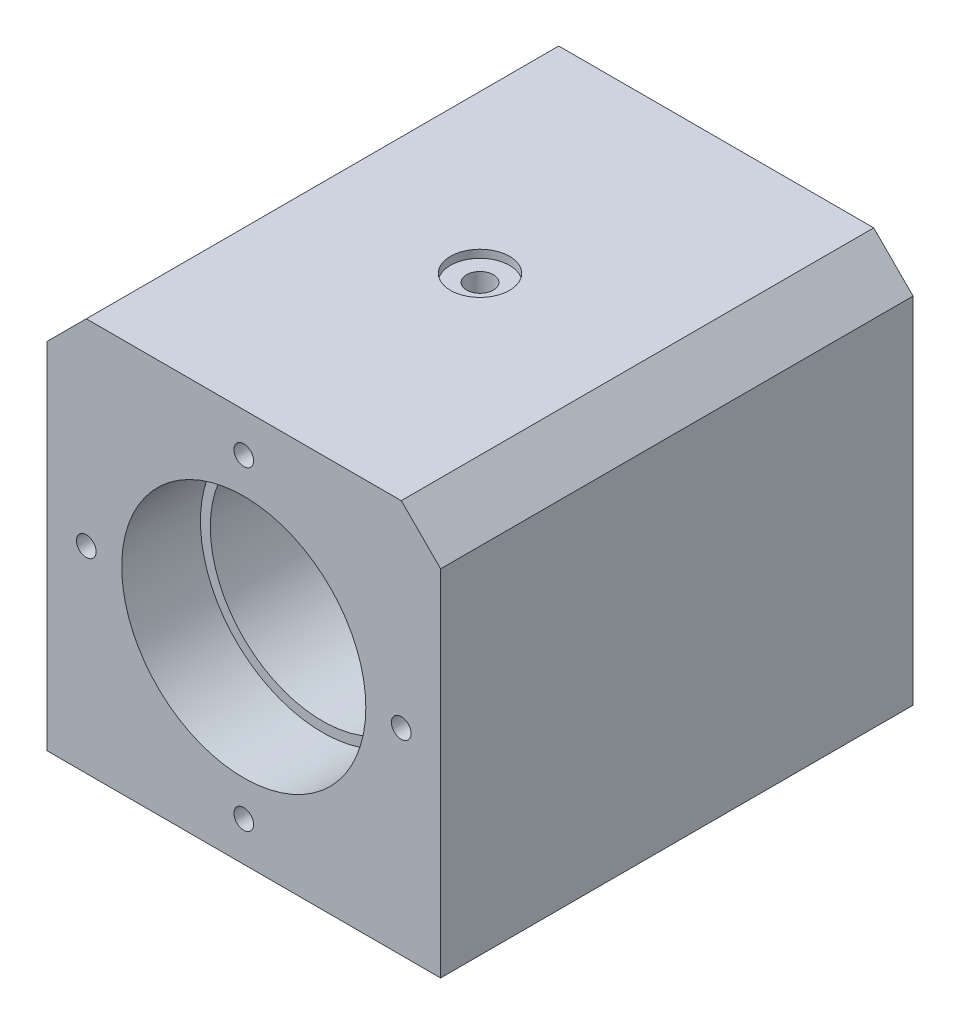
from build123d import *

# Parameters (mm, degrees)
SKIZZE2_W                          = 100
SKIZZE2_H                          = 100
AUFSATZ_LINEAR_AUSTRAGEN1_DEPTH    = 60
FASE1_SIZE                         = 10
SKIZZE3_R                          = 7.5
SCHNITT_LINEAR_AUSTRAGEN1_DEPTH    = 2
SKIZZE4_R                          = 31
SCHNITT_LINEAR_AUSTRAGEN2_DEPTH    = 20
SKIZZE4_3_R                        = 28.5
SCHNITT_LINEAR_AUSTRAGEN3_DEPTH    = 140.283882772
M8_GEWINDEBOHRUNG1_D               = 6.8
M8_GEWINDEBOHRUNG1_DEPTH           = 22.25
M8_GEWINDEBOHRUNG1_TIP             = 2.042926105
M6_GEWINDEBOHRUNG1_AT_2_COUNT      = 2
M6_GEWINDEBOHRUNG1_AT_2_PITCH      = 56.568542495
M6_GEWINDEBOHRUNG1_AT_3_COUNT      = 2
M6_GEWINDEBOHRUNG1_AT_3_PITCH      = 80
M6_GEWINDEBOHRUNG1_AT_4_COUNT      = 2
M6_GEWINDEBOHRUNG1_AT_4_PITCH      = 56.568542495
F_6_0_6_DURCHMESSER_BOHRUNG1_D     = 6
F_6_0_6_DURCHMESSER_BOHRUNG1_DEPTH = 15
F_6_0_6_DURCHMESSER_BOHRUNG1_TIP   = 1.802581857
M8_GEWINDEBOHRUNG2_D               = 6.8
M8_GEWINDEBOHRUNG2_DEPTH           = 20
M8_GEWINDEBOHRUNG2_TIP             = 2.042926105


with BuildPart() as part:
    # Skizze2 → Aufsatz-Linear austragen1 (new, symmetric)
    with BuildSketch(Plane.XY):
        Rectangle(SKIZZE2_W, SKIZZE2_H)
    extrude(amount=AUFSATZ_LINEAR_AUSTRAGEN1_DEPTH, both=True)

    # Fase1
    fase1_edges = [part.edges().sort_by_distance(p)[0] for p in [
        (-50, 50, 0),
        (50, 50, 0),
    ]]
    chamfer(fase1_edges, length=FASE1_SIZE)

    # Skizze3 → Schnitt-Linear austragen1 (cut)
    with BuildSketch(Plane(origin=(0, 50, 0), x_dir=(1, 0, 0), z_dir=(0, 1, 0))):
        with Locations(Location((0, 0, 0), (0, 0, 270))):
            Circle(SKIZZE3_R)
    extrude(amount=-SCHNITT_LINEAR_AUSTRAGEN1_DEPTH, mode=Mode.SUBTRACT)

    # Skizze4 → Schnitt-Linear austragen2 (cut)
    with BuildSketch(Plane.XY.offset(60)):
        Circle(SKIZZE4_R)
    schnitt_linear_austragen2 = extrude(amount=-SCHNITT_LINEAR_AUSTRAGEN2_DEPTH, mode=Mode.SUBTRACT)

    # Spiegeln1: Schnitt-Linear austragen2 across plane
    add(schnitt_linear_austragen2.mirror(Plane.XY), mode=Mode.SUBTRACT)

    # Skizze4_3 → Schnitt-Linear austragen3 (cut, through all)
    with BuildSketch(Plane.XY.offset(60)):
        Circle(SKIZZE4_3_R)
    extrude(amount=-SCHNITT_LINEAR_AUSTRAGEN3_DEPTH, mode=Mode.SUBTRACT)

    # M8 Gewindebohrung1
    with Locations(Plane(origin=(0, 48, 0), x_dir=(1, 0, 0), z_dir=(0, 1, 0))):
        with Locations((0, 0)):
            Hole(M8_GEWINDEBOHRUNG1_D / 2, depth=M8_GEWINDEBOHRUNG1_DEPTH)
            with Locations((0, 0, -(M8_GEWINDEBOHRUNG1_DEPTH + M8_GEWINDEBOHRUNG1_TIP / 2))):  # 118° drill point
                Cone(0, M8_GEWINDEBOHRUNG1_D / 2, M8_GEWINDEBOHRUNG1_TIP, mode=Mode.SUBTRACT)

    # Skizze8 → M6 Gewindebohrung1 (revolve, cut)
    with BuildSketch(Plane(origin=(0, 40, 60), x_dir=(0, -1, 0), z_dir=(1, 0, 0))):
        Polygon((0, 0), (0, 21.502151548), (2.5, 20), (2.5, 0), align=None)
    m6_gewindebohrung1 = revolve(axis=Axis((0, 40, 66.35), (0, 0, -1)), mode=Mode.SUBTRACT)

    # M6 Gewindebohrung1 at 2: M6 Gewindebohrung1 ×2
    with Locations(*[Vector(0.7071067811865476, -0.7071067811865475, 0) * (i * M6_GEWINDEBOHRUNG1_AT_2_PITCH) for i in range(1, M6_GEWINDEBOHRUNG1_AT_2_COUNT)]):
        add(m6_gewindebohrung1, mode=Mode.SUBTRACT)

    # M6 Gewindebohrung1 at 3: M6 Gewindebohrung1 ×2
    with Locations(*[(0, -i * M6_GEWINDEBOHRUNG1_AT_3_PITCH, 0) for i in range(1, M6_GEWINDEBOHRUNG1_AT_3_COUNT)]):
        add(m6_gewindebohrung1, mode=Mode.SUBTRACT)

    # M6 Gewindebohrung1 at 4: M6 Gewindebohrung1 ×2
    with Locations(*[Vector(-0.7071067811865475, -0.7071067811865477, 0) * (i * M6_GEWINDEBOHRUNG1_AT_4_PITCH) for i in range(1, M6_GEWINDEBOHRUNG1_AT_4_COUNT)]):
        add(m6_gewindebohrung1, mode=Mode.SUBTRACT)

    # Spiegeln2: M6 Gewindebohrung1 across plane
    add(m6_gewindebohrung1.mirror(Plane.XY), mode=Mode.SUBTRACT)

    # Spiegeln2 copy 1 sketch → Spiegeln2 copy 1 (revolve, cut)
    with BuildSketch(Plane(origin=(40, 0, -60), x_dir=(0, -1, 0), z_dir=(1, 0, 0))):
        Polygon((0, 0), (0, -21.502151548), (2.5, -20), (2.5, 0), align=None)
    revolve(axis=Axis((40, 0, -66.35), (0, 0, -1)), mode=Mode.SUBTRACT)

    # Spiegeln2 copy 2 sketch → Spiegeln2 copy 2 (revolve, cut)
    with BuildSketch(Plane(origin=(0, -40, -60), x_dir=(0, -1, 0), z_dir=(1, 0, 0))):
        Polygon((0, 0), (0, -21.502151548), (2.5, -20), (2.5, 0), align=None)
    revolve(axis=Axis((0, -40, -66.35), (0, 0, -1)), mode=Mode.SUBTRACT)

    # Spiegeln2 copy 3 sketch → Spiegeln2 copy 3 (revolve, cut)
    with BuildSketch(Plane(origin=(-40, 0, -60), x_dir=(0, -1, 0), z_dir=(1, 0, 0))):
        Polygon((0, 0), (0, -21.502151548), (2.5, -20), (2.5, 0), align=None)
    revolve(axis=Axis((-40, 0, -66.35), (0, 0, -1)), mode=Mode.SUBTRACT)

    # 6.0 _6_ Durchmesser Bohrung1
    with Locations(Plane(origin=(0, -50, 0), x_dir=(-1, 0, 0), z_dir=(0, -1, 0))):
        with Locations((30, -40), (-30, -40)):
            Hole(F_6_0_6_DURCHMESSER_BOHRUNG1_D / 2, depth=F_6_0_6_DURCHMESSER_BOHRUNG1_DEPTH)
            with Locations((0, 0, -(F_6_0_6_DURCHMESSER_BOHRUNG1_DEPTH + F_6_0_6_DURCHMESSER_BOHRUNG1_TIP / 2))):  # 118° drill point
                Cone(0, F_6_0_6_DURCHMESSER_BOHRUNG1_D / 2, F_6_0_6_DURCHMESSER_BOHRUNG1_TIP, mode=Mode.SUBTRACT)

    # M8 Gewindebohrung2
    with Locations(Plane(origin=(0, -50, 0), x_dir=(-1, 0, 0), z_dir=(0, -1, 0))):
        with Locations((18, -40), (-18, -40)):
            Hole(M8_GEWINDEBOHRUNG2_D / 2, depth=M8_GEWINDEBOHRUNG2_DEPTH)
            with Locations((0, 0, -(M8_GEWINDEBOHRUNG2_DEPTH + M8_GEWINDEBOHRUNG2_TIP / 2))):  # 118° drill point
                Cone(0, M8_GEWINDEBOHRUNG2_D / 2, M8_GEWINDEBOHRUNG2_TIP, mode=Mode.SUBTRACT)


solid = part.part
